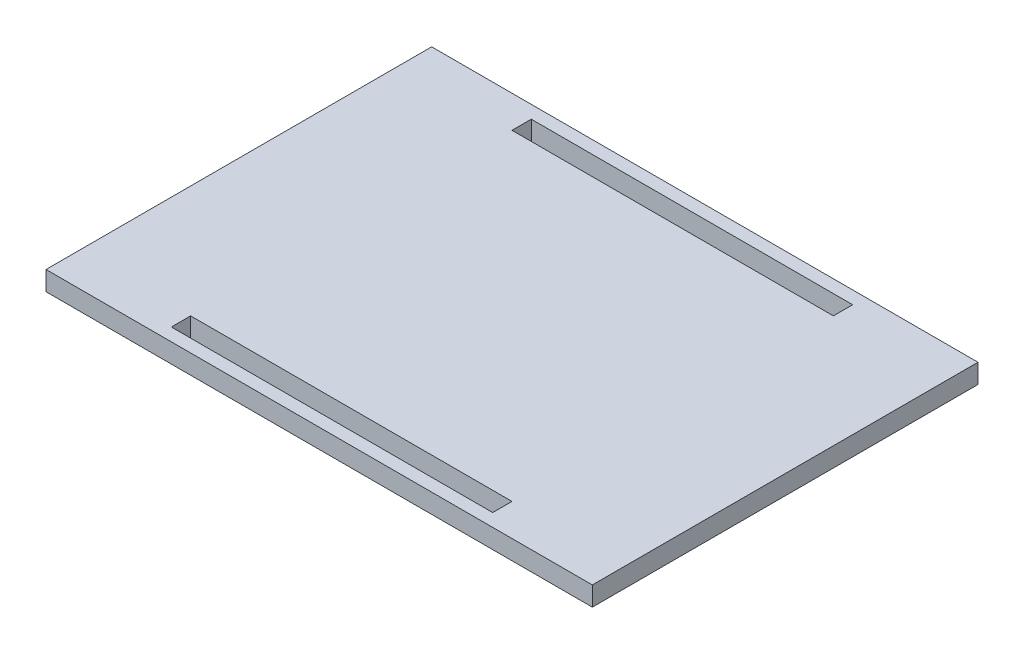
ISO-10303-21;
HEADER;
FILE_DESCRIPTION(('STEP AP214'),'2;1');
FILE_NAME('part.step','',(''),(''),'','','');
FILE_SCHEMA(('AUTOMOTIVE_DESIGN { 1 0 10303 214 1 1 1 1 }'));
ENDSEC;
DATA;
#1=APPLICATION_CONTEXT('core data for automotive mechanical design processes');
#2=APPLICATION_PROTOCOL_DEFINITION('international standard','automotive_design',2000,#1);
#3=PRODUCT_CONTEXT('',#1,'mechanical');
#4=PRODUCT('Part','Part','',(#3));
#5=PRODUCT_RELATED_PRODUCT_CATEGORY('part','',(#4));
#6=PRODUCT_DEFINITION_FORMATION('','',#4);
#7=PRODUCT_DEFINITION_CONTEXT('part definition',#1,'design');
#8=PRODUCT_DEFINITION('design','',#6,#7);
#9=PRODUCT_DEFINITION_SHAPE('','',#8);
#10=(LENGTH_UNIT() NAMED_UNIT(*) SI_UNIT(.MILLI.,.METRE.));
#11=(NAMED_UNIT(*) PLANE_ANGLE_UNIT() SI_UNIT($,.RADIAN.));
#12=(NAMED_UNIT(*) SI_UNIT($,.STERADIAN.) SOLID_ANGLE_UNIT());
#13=UNCERTAINTY_MEASURE_WITH_UNIT(LENGTH_MEASURE(1.E-05),#10,'distance_accuracy_value','');
#14=(GEOMETRIC_REPRESENTATION_CONTEXT(3) GLOBAL_UNCERTAINTY_ASSIGNED_CONTEXT((#13)) GLOBAL_UNIT_ASSIGNED_CONTEXT((#10,
#11,#12)) REPRESENTATION_CONTEXT('',''));
#15=CARTESIAN_POINT('',(0.,0.,0.));
#16=DIRECTION('',(0.,0.,1.));
#17=DIRECTION('',(1.,0.,0.));
#18=AXIS2_PLACEMENT_3D('',#15,#16,#17);
#19=CARTESIAN_POINT('',(0.,3.,0.));
#20=DIRECTION('',(0.,1.,0.));
#21=DIRECTION('',(0.,0.,1.));
#22=AXIS2_PLACEMENT_3D('',#19,#20,#21);
#23=PLANE('',#22);
#24=DIRECTION('',(-1.,0.,0.));
#25=VECTOR('',#24,1.);
#26=CARTESIAN_POINT('',(-25.,3.,-28.));
#27=LINE('',#26,#25);
#28=CARTESIAN_POINT('',(25.,3.,-28.));
#29=VERTEX_POINT('',#28);
#30=CARTESIAN_POINT('',(-25.,3.,-28.));
#31=VERTEX_POINT('',#30);
#32=EDGE_CURVE('E160',#29,#31,#27,.T.);
#33=ORIENTED_EDGE('',*,*,#32,.F.);
#34=DIRECTION('',(0.,0.,-1.));
#35=VECTOR('',#34,1.);
#36=CARTESIAN_POINT('',(25.,3.,-28.));
#37=LINE('',#36,#35);
#38=CARTESIAN_POINT('',(25.,3.,-25.));
#39=VERTEX_POINT('',#38);
#40=EDGE_CURVE('E158',#39,#29,#37,.T.);
#41=ORIENTED_EDGE('',*,*,#40,.F.);
#42=DIRECTION('',(1.,0.,0.));
#43=VECTOR('',#42,1.);
#44=CARTESIAN_POINT('',(-25.,3.,-25.));
#45=LINE('',#44,#43);
#46=CARTESIAN_POINT('',(-25.,3.,-25.));
#47=VERTEX_POINT('',#46);
#48=EDGE_CURVE('E166',#47,#39,#45,.T.);
#49=ORIENTED_EDGE('',*,*,#48,.F.);
#50=DIRECTION('',(0.,0.,1.));
#51=VECTOR('',#50,1.);
#52=CARTESIAN_POINT('',(-25.,3.,-28.));
#53=LINE('',#52,#51);
#54=EDGE_CURVE('E163',#31,#47,#53,.T.);
#55=ORIENTED_EDGE('',*,*,#54,.F.);
#56=EDGE_LOOP('',(#33,#41,#49,#55));
#57=FACE_BOUND('',#56,.T.);
#58=DIRECTION('',(0.,0.,-1.));
#59=VECTOR('',#58,1.);
#60=CARTESIAN_POINT('',(42.5,3.,-30.));
#61=LINE('',#60,#59);
#62=CARTESIAN_POINT('',(42.5,3.,30.));
#63=VERTEX_POINT('',#62);
#64=CARTESIAN_POINT('',(42.5,3.,-30.));
#65=VERTEX_POINT('',#64);
#66=EDGE_CURVE('E189',#63,#65,#61,.T.);
#67=ORIENTED_EDGE('',*,*,#66,.T.);
#68=DIRECTION('',(-1.,0.,0.));
#69=VECTOR('',#68,1.);
#70=CARTESIAN_POINT('',(-42.5,3.,-30.));
#71=LINE('',#70,#69);
#72=CARTESIAN_POINT('',(-42.5,3.,-30.));
#73=VERTEX_POINT('',#72);
#74=EDGE_CURVE('E192',#65,#73,#71,.T.);
#75=ORIENTED_EDGE('',*,*,#74,.T.);
#76=DIRECTION('',(0.,0.,1.));
#77=VECTOR('',#76,1.);
#78=CARTESIAN_POINT('',(-42.5,3.,-30.));
#79=LINE('',#78,#77);
#80=CARTESIAN_POINT('',(-42.5,3.,30.));
#81=VERTEX_POINT('',#80);
#82=EDGE_CURVE('E195',#73,#81,#79,.T.);
#83=ORIENTED_EDGE('',*,*,#82,.T.);
#84=DIRECTION('',(1.,0.,0.));
#85=VECTOR('',#84,1.);
#86=CARTESIAN_POINT('',(-42.5,3.,30.));
#87=LINE('',#86,#85);
#88=EDGE_CURVE('E197',#81,#63,#87,.T.);
#89=ORIENTED_EDGE('',*,*,#88,.T.);
#90=EDGE_LOOP('',(#67,#75,#83,#89));
#91=FACE_BOUND('',#90,.T.);
#92=DIRECTION('',(-1.,0.,0.));
#93=VECTOR('',#92,1.);
#94=CARTESIAN_POINT('',(-25.,3.,25.));
#95=LINE('',#94,#93);
#96=CARTESIAN_POINT('',(25.,3.,25.));
#97=VERTEX_POINT('',#96);
#98=CARTESIAN_POINT('',(-25.,3.,25.));
#99=VERTEX_POINT('',#98);
#100=EDGE_CURVE('E130',#97,#99,#95,.T.);
#101=ORIENTED_EDGE('',*,*,#100,.F.);
#102=DIRECTION('',(0.,0.,-1.));
#103=VECTOR('',#102,1.);
#104=CARTESIAN_POINT('',(25.,3.,25.));
#105=LINE('',#104,#103);
#106=CARTESIAN_POINT('',(25.,3.,28.));
#107=VERTEX_POINT('',#106);
#108=EDGE_CURVE('E122',#107,#97,#105,.T.);
#109=ORIENTED_EDGE('',*,*,#108,.F.);
#110=DIRECTION('',(1.,0.,0.));
#111=VECTOR('',#110,1.);
#112=CARTESIAN_POINT('',(-25.,3.,28.));
#113=LINE('',#112,#111);
#114=CARTESIAN_POINT('',(-25.,3.,28.));
#115=VERTEX_POINT('',#114);
#116=EDGE_CURVE('E144',#115,#107,#113,.T.);
#117=ORIENTED_EDGE('',*,*,#116,.F.);
#118=DIRECTION('',(0.,0.,1.));
#119=VECTOR('',#118,1.);
#120=CARTESIAN_POINT('',(-25.,3.,25.));
#121=LINE('',#120,#119);
#122=EDGE_CURVE('E142',#99,#115,#121,.T.);
#123=ORIENTED_EDGE('',*,*,#122,.F.);
#124=EDGE_LOOP('',(#101,#109,#117,#123));
#125=FACE_BOUND('',#124,.T.);
#126=ADVANCED_FACE('F33',(#57,#91,#125),#23,.T.);
#127=CARTESIAN_POINT('',(0.,0.,0.));
#128=DIRECTION('',(0.,1.,0.));
#129=DIRECTION('',(0.,0.,1.));
#130=AXIS2_PLACEMENT_3D('',#127,#128,#129);
#131=PLANE('',#130);
#132=DIRECTION('',(0.,0.,-1.));
#133=VECTOR('',#132,1.);
#134=CARTESIAN_POINT('',(25.,0.,-28.));
#135=LINE('',#134,#133);
#136=CARTESIAN_POINT('',(25.,0.,-25.));
#137=VERTEX_POINT('',#136);
#138=CARTESIAN_POINT('',(25.,0.,-28.));
#139=VERTEX_POINT('',#138);
#140=EDGE_CURVE('E138',#137,#139,#135,.T.);
#141=ORIENTED_EDGE('',*,*,#140,.T.);
#142=DIRECTION('',(-1.,0.,0.));
#143=VECTOR('',#142,1.);
#144=CARTESIAN_POINT('',(-25.,0.,-28.));
#145=LINE('',#144,#143);
#146=CARTESIAN_POINT('',(-25.,0.,-28.));
#147=VERTEX_POINT('',#146);
#148=EDGE_CURVE('E171',#139,#147,#145,.T.);
#149=ORIENTED_EDGE('',*,*,#148,.T.);
#150=DIRECTION('',(0.,0.,1.));
#151=VECTOR('',#150,1.);
#152=CARTESIAN_POINT('',(-25.,0.,-28.));
#153=LINE('',#152,#151);
#154=CARTESIAN_POINT('',(-25.,0.,-25.));
#155=VERTEX_POINT('',#154);
#156=EDGE_CURVE('E174',#147,#155,#153,.T.);
#157=ORIENTED_EDGE('',*,*,#156,.T.);
#158=DIRECTION('',(1.,0.,0.));
#159=VECTOR('',#158,1.);
#160=CARTESIAN_POINT('',(-25.,0.,-25.));
#161=LINE('',#160,#159);
#162=EDGE_CURVE('E161',#155,#137,#161,.T.);
#163=ORIENTED_EDGE('',*,*,#162,.T.);
#164=EDGE_LOOP('',(#141,#149,#157,#163));
#165=FACE_BOUND('',#164,.T.);
#166=DIRECTION('',(0.,0.,-1.));
#167=VECTOR('',#166,1.);
#168=CARTESIAN_POINT('',(42.5,0.,-30.));
#169=LINE('',#168,#167);
#170=CARTESIAN_POINT('',(42.5,0.,30.));
#171=VERTEX_POINT('',#170);
#172=CARTESIAN_POINT('',(42.5,0.,-30.));
#173=VERTEX_POINT('',#172);
#174=EDGE_CURVE('E188',#171,#173,#169,.T.);
#175=ORIENTED_EDGE('',*,*,#174,.F.);
#176=DIRECTION('',(1.,0.,0.));
#177=VECTOR('',#176,1.);
#178=CARTESIAN_POINT('',(-42.5,0.,30.));
#179=LINE('',#178,#177);
#180=CARTESIAN_POINT('',(-42.5,0.,30.));
#181=VERTEX_POINT('',#180);
#182=EDGE_CURVE('E193',#181,#171,#179,.T.);
#183=ORIENTED_EDGE('',*,*,#182,.F.);
#184=DIRECTION('',(0.,0.,1.));
#185=VECTOR('',#184,1.);
#186=CARTESIAN_POINT('',(-42.5,0.,-30.));
#187=LINE('',#186,#185);
#188=CARTESIAN_POINT('',(-42.5,0.,-30.));
#189=VERTEX_POINT('',#188);
#190=EDGE_CURVE('E204',#189,#181,#187,.T.);
#191=ORIENTED_EDGE('',*,*,#190,.F.);
#192=DIRECTION('',(-1.,0.,0.));
#193=VECTOR('',#192,1.);
#194=CARTESIAN_POINT('',(-42.5,0.,-30.));
#195=LINE('',#194,#193);
#196=EDGE_CURVE('E202',#173,#189,#195,.T.);
#197=ORIENTED_EDGE('',*,*,#196,.F.);
#198=EDGE_LOOP('',(#175,#183,#191,#197));
#199=FACE_BOUND('',#198,.T.);
#200=DIRECTION('',(0.,0.,-1.));
#201=VECTOR('',#200,1.);
#202=CARTESIAN_POINT('',(25.,0.,25.));
#203=LINE('',#202,#201);
#204=CARTESIAN_POINT('',(25.,0.,28.));
#205=VERTEX_POINT('',#204);
#206=CARTESIAN_POINT('',(25.,0.,25.));
#207=VERTEX_POINT('',#206);
#208=EDGE_CURVE('E56',#205,#207,#203,.T.);
#209=ORIENTED_EDGE('',*,*,#208,.T.);
#210=DIRECTION('',(-1.,0.,0.));
#211=VECTOR('',#210,1.);
#212=CARTESIAN_POINT('',(-25.,0.,25.));
#213=LINE('',#212,#211);
#214=CARTESIAN_POINT('',(-25.,0.,25.));
#215=VERTEX_POINT('',#214);
#216=EDGE_CURVE('E137',#207,#215,#213,.T.);
#217=ORIENTED_EDGE('',*,*,#216,.T.);
#218=DIRECTION('',(0.,0.,1.));
#219=VECTOR('',#218,1.);
#220=CARTESIAN_POINT('',(-25.,0.,25.));
#221=LINE('',#220,#219);
#222=CARTESIAN_POINT('',(-25.,0.,28.));
#223=VERTEX_POINT('',#222);
#224=EDGE_CURVE('E150',#215,#223,#221,.T.);
#225=ORIENTED_EDGE('',*,*,#224,.T.);
#226=DIRECTION('',(1.,0.,0.));
#227=VECTOR('',#226,1.);
#228=CARTESIAN_POINT('',(-25.,0.,28.));
#229=LINE('',#228,#227);
#230=EDGE_CURVE('E131',#223,#205,#229,.T.);
#231=ORIENTED_EDGE('',*,*,#230,.T.);
#232=EDGE_LOOP('',(#209,#217,#225,#231));
#233=FACE_BOUND('',#232,.T.);
#234=ADVANCED_FACE('F222',(#165,#199,#233),#131,.F.);
#235=CARTESIAN_POINT('',(42.5,3.,-30.));
#236=DIRECTION('',(-1.,0.,0.));
#237=DIRECTION('',(0.,0.,1.));
#238=AXIS2_PLACEMENT_3D('',#235,#236,#237);
#239=PLANE('',#238);
#240=ORIENTED_EDGE('',*,*,#174,.T.);
#241=DIRECTION('',(0.,-1.,0.));
#242=VECTOR('',#241,1.);
#243=CARTESIAN_POINT('',(42.5,3.,-30.));
#244=LINE('',#243,#242);
#245=EDGE_CURVE('E11',#65,#173,#244,.T.);
#246=ORIENTED_EDGE('',*,*,#245,.F.);
#247=ORIENTED_EDGE('',*,*,#66,.F.);
#248=DIRECTION('',(0.,-1.,0.));
#249=VECTOR('',#248,1.);
#250=CARTESIAN_POINT('',(42.5,3.,30.));
#251=LINE('',#250,#249);
#252=EDGE_CURVE('E199',#63,#171,#251,.T.);
#253=ORIENTED_EDGE('',*,*,#252,.T.);
#254=EDGE_LOOP('',(#240,#246,#247,#253));
#255=FACE_BOUND('',#254,.T.);
#256=ADVANCED_FACE('F35',(#255),#239,.F.);
#257=CARTESIAN_POINT('',(-42.5,3.,-30.));
#258=DIRECTION('',(0.,0.,1.));
#259=DIRECTION('',(1.,0.,0.));
#260=AXIS2_PLACEMENT_3D('',#257,#258,#259);
#261=PLANE('',#260);
#262=ORIENTED_EDGE('',*,*,#196,.T.);
#263=DIRECTION('',(0.,-1.,0.));
#264=VECTOR('',#263,1.);
#265=CARTESIAN_POINT('',(-42.5,3.,-30.));
#266=LINE('',#265,#264);
#267=EDGE_CURVE('E41',#73,#189,#266,.T.);
#268=ORIENTED_EDGE('',*,*,#267,.F.);
#269=ORIENTED_EDGE('',*,*,#74,.F.);
#270=ORIENTED_EDGE('',*,*,#245,.T.);
#271=EDGE_LOOP('',(#262,#268,#269,#270));
#272=FACE_BOUND('',#271,.T.);
#273=ADVANCED_FACE('F232',(#272),#261,.F.);
#274=CARTESIAN_POINT('',(-42.5,3.,-30.));
#275=DIRECTION('',(1.,0.,0.));
#276=DIRECTION('',(0.,0.,-1.));
#277=AXIS2_PLACEMENT_3D('',#274,#275,#276);
#278=PLANE('',#277);
#279=ORIENTED_EDGE('',*,*,#190,.T.);
#280=DIRECTION('',(0.,-1.,0.));
#281=VECTOR('',#280,1.);
#282=CARTESIAN_POINT('',(-42.5,3.,30.));
#283=LINE('',#282,#281);
#284=EDGE_CURVE('E209',#81,#181,#283,.T.);
#285=ORIENTED_EDGE('',*,*,#284,.F.);
#286=ORIENTED_EDGE('',*,*,#82,.F.);
#287=ORIENTED_EDGE('',*,*,#267,.T.);
#288=EDGE_LOOP('',(#279,#285,#286,#287));
#289=FACE_BOUND('',#288,.T.);
#290=ADVANCED_FACE('F216',(#289),#278,.F.);
#291=CARTESIAN_POINT('',(-42.5,3.,30.));
#292=DIRECTION('',(0.,0.,-1.));
#293=DIRECTION('',(-1.,0.,0.));
#294=AXIS2_PLACEMENT_3D('',#291,#292,#293);
#295=PLANE('',#294);
#296=ORIENTED_EDGE('',*,*,#182,.T.);
#297=ORIENTED_EDGE('',*,*,#252,.F.);
#298=ORIENTED_EDGE('',*,*,#88,.F.);
#299=ORIENTED_EDGE('',*,*,#284,.T.);
#300=EDGE_LOOP('',(#296,#297,#298,#299));
#301=FACE_BOUND('',#300,.T.);
#302=ADVANCED_FACE('F226',(#301),#295,.F.);
#303=CARTESIAN_POINT('',(25.,3.,-28.));
#304=DIRECTION('',(-1.,0.,0.));
#305=DIRECTION('',(0.,0.,1.));
#306=AXIS2_PLACEMENT_3D('',#303,#304,#305);
#307=PLANE('',#306);
#308=ORIENTED_EDGE('',*,*,#140,.F.);
#309=DIRECTION('',(0.,-1.,0.));
#310=VECTOR('',#309,1.);
#311=CARTESIAN_POINT('',(25.,3.,-25.));
#312=LINE('',#311,#310);
#313=EDGE_CURVE('E168',#39,#137,#312,.T.);
#314=ORIENTED_EDGE('',*,*,#313,.F.);
#315=ORIENTED_EDGE('',*,*,#40,.T.);
#316=DIRECTION('',(0.,-1.,0.));
#317=VECTOR('',#316,1.);
#318=CARTESIAN_POINT('',(25.,3.,-28.));
#319=LINE('',#318,#317);
#320=EDGE_CURVE('E185',#29,#139,#319,.T.);
#321=ORIENTED_EDGE('',*,*,#320,.T.);
#322=EDGE_LOOP('',(#308,#314,#315,#321));
#323=FACE_BOUND('',#322,.T.);
#324=ADVANCED_FACE('F249',(#323),#307,.T.);
#325=CARTESIAN_POINT('',(-25.,3.,-28.));
#326=DIRECTION('',(0.,0.,1.));
#327=DIRECTION('',(1.,0.,0.));
#328=AXIS2_PLACEMENT_3D('',#325,#326,#327);
#329=PLANE('',#328);
#330=ORIENTED_EDGE('',*,*,#148,.F.);
#331=ORIENTED_EDGE('',*,*,#320,.F.);
#332=ORIENTED_EDGE('',*,*,#32,.T.);
#333=DIRECTION('',(0.,-1.,0.));
#334=VECTOR('',#333,1.);
#335=CARTESIAN_POINT('',(-25.,3.,-28.));
#336=LINE('',#335,#334);
#337=EDGE_CURVE('E183',#31,#147,#336,.T.);
#338=ORIENTED_EDGE('',*,*,#337,.T.);
#339=EDGE_LOOP('',(#330,#331,#332,#338));
#340=FACE_BOUND('',#339,.T.);
#341=ADVANCED_FACE('F256',(#340),#329,.T.);
#342=CARTESIAN_POINT('',(-25.,3.,-28.));
#343=DIRECTION('',(1.,0.,0.));
#344=DIRECTION('',(0.,0.,-1.));
#345=AXIS2_PLACEMENT_3D('',#342,#343,#344);
#346=PLANE('',#345);
#347=ORIENTED_EDGE('',*,*,#156,.F.);
#348=ORIENTED_EDGE('',*,*,#337,.F.);
#349=ORIENTED_EDGE('',*,*,#54,.T.);
#350=DIRECTION('',(0.,-1.,0.));
#351=VECTOR('',#350,1.);
#352=CARTESIAN_POINT('',(-25.,3.,-25.));
#353=LINE('',#352,#351);
#354=EDGE_CURVE('E181',#47,#155,#353,.T.);
#355=ORIENTED_EDGE('',*,*,#354,.T.);
#356=EDGE_LOOP('',(#347,#348,#349,#355));
#357=FACE_BOUND('',#356,.T.);
#358=ADVANCED_FACE('F261',(#357),#346,.T.);
#359=CARTESIAN_POINT('',(-25.,3.,-25.));
#360=DIRECTION('',(0.,0.,-1.));
#361=DIRECTION('',(-1.,0.,0.));
#362=AXIS2_PLACEMENT_3D('',#359,#360,#361);
#363=PLANE('',#362);
#364=ORIENTED_EDGE('',*,*,#162,.F.);
#365=ORIENTED_EDGE('',*,*,#354,.F.);
#366=ORIENTED_EDGE('',*,*,#48,.T.);
#367=ORIENTED_EDGE('',*,*,#313,.T.);
#368=EDGE_LOOP('',(#364,#365,#366,#367));
#369=FACE_BOUND('',#368,.T.);
#370=ADVANCED_FACE('F268',(#369),#363,.T.);
#371=CARTESIAN_POINT('',(25.,3.,25.));
#372=DIRECTION('',(-1.,0.,0.));
#373=DIRECTION('',(0.,0.,1.));
#374=AXIS2_PLACEMENT_3D('',#371,#372,#373);
#375=PLANE('',#374);
#376=ORIENTED_EDGE('',*,*,#208,.F.);
#377=DIRECTION('',(0.,-1.,0.));
#378=VECTOR('',#377,1.);
#379=CARTESIAN_POINT('',(25.,3.,28.));
#380=LINE('',#379,#378);
#381=EDGE_CURVE('E126',#107,#205,#380,.T.);
#382=ORIENTED_EDGE('',*,*,#381,.F.);
#383=ORIENTED_EDGE('',*,*,#108,.T.);
#384=DIRECTION('',(0.,-1.,0.));
#385=VECTOR('',#384,1.);
#386=CARTESIAN_POINT('',(25.,3.,25.));
#387=LINE('',#386,#385);
#388=EDGE_CURVE('E125',#97,#207,#387,.T.);
#389=ORIENTED_EDGE('',*,*,#388,.T.);
#390=EDGE_LOOP('',(#376,#382,#383,#389));
#391=FACE_BOUND('',#390,.T.);
#392=ADVANCED_FACE('F124',(#391),#375,.T.);
#393=CARTESIAN_POINT('',(-25.,3.,25.));
#394=DIRECTION('',(0.,0.,1.));
#395=DIRECTION('',(1.,0.,0.));
#396=AXIS2_PLACEMENT_3D('',#393,#394,#395);
#397=PLANE('',#396);
#398=ORIENTED_EDGE('',*,*,#216,.F.);
#399=ORIENTED_EDGE('',*,*,#388,.F.);
#400=ORIENTED_EDGE('',*,*,#100,.T.);
#401=DIRECTION('',(0.,-1.,0.));
#402=VECTOR('',#401,1.);
#403=CARTESIAN_POINT('',(-25.,3.,25.));
#404=LINE('',#403,#402);
#405=EDGE_CURVE('E139',#99,#215,#404,.T.);
#406=ORIENTED_EDGE('',*,*,#405,.T.);
#407=EDGE_LOOP('',(#398,#399,#400,#406));
#408=FACE_BOUND('',#407,.T.);
#409=ADVANCED_FACE('F134',(#408),#397,.T.);
#410=CARTESIAN_POINT('',(-25.,3.,25.));
#411=DIRECTION('',(1.,0.,0.));
#412=DIRECTION('',(0.,0.,-1.));
#413=AXIS2_PLACEMENT_3D('',#410,#411,#412);
#414=PLANE('',#413);
#415=ORIENTED_EDGE('',*,*,#224,.F.);
#416=ORIENTED_EDGE('',*,*,#405,.F.);
#417=ORIENTED_EDGE('',*,*,#122,.T.);
#418=DIRECTION('',(0.,-1.,0.));
#419=VECTOR('',#418,1.);
#420=CARTESIAN_POINT('',(-25.,3.,28.));
#421=LINE('',#420,#419);
#422=EDGE_CURVE('E48',#115,#223,#421,.T.);
#423=ORIENTED_EDGE('',*,*,#422,.T.);
#424=EDGE_LOOP('',(#415,#416,#417,#423));
#425=FACE_BOUND('',#424,.T.);
#426=ADVANCED_FACE('F285',(#425),#414,.T.);
#427=CARTESIAN_POINT('',(-25.,3.,28.));
#428=DIRECTION('',(0.,0.,-1.));
#429=DIRECTION('',(-1.,0.,0.));
#430=AXIS2_PLACEMENT_3D('',#427,#428,#429);
#431=PLANE('',#430);
#432=ORIENTED_EDGE('',*,*,#230,.F.);
#433=ORIENTED_EDGE('',*,*,#422,.F.);
#434=ORIENTED_EDGE('',*,*,#116,.T.);
#435=ORIENTED_EDGE('',*,*,#381,.T.);
#436=EDGE_LOOP('',(#432,#433,#434,#435));
#437=FACE_BOUND('',#436,.T.);
#438=ADVANCED_FACE('F288',(#437),#431,.T.);
#439=CLOSED_SHELL('',(#126,#234,#256,#273,#290,#302,#324,#341,#358,#370,#392,#409,#426,#438));
#440=MANIFOLD_SOLID_BREP('B2',#439);
#441=ADVANCED_BREP_SHAPE_REPRESENTATION('',(#18,#440),#14);
#442=SHAPE_DEFINITION_REPRESENTATION(#9,#441);
ENDSEC;
END-ISO-10303-21;
